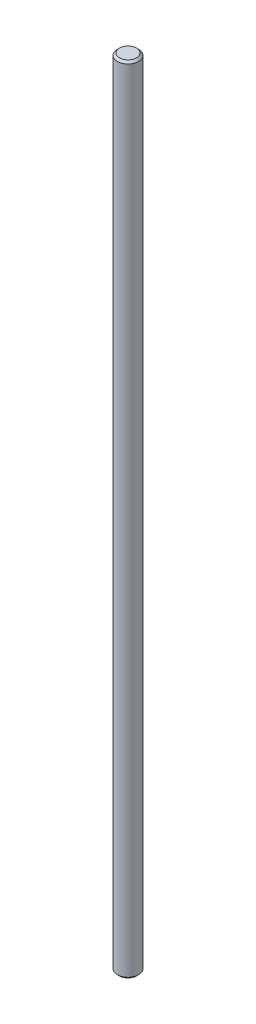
ISO-10303-21;
HEADER;
FILE_DESCRIPTION(('STEP AP214'),'2;1');
FILE_NAME('part.step','',(''),(''),'','','');
FILE_SCHEMA(('AUTOMOTIVE_DESIGN { 1 0 10303 214 1 1 1 1 }'));
ENDSEC;
DATA;
#1=APPLICATION_CONTEXT('core data for automotive mechanical design processes');
#2=APPLICATION_PROTOCOL_DEFINITION('international standard','automotive_design',2000,#1);
#3=PRODUCT_CONTEXT('',#1,'mechanical');
#4=PRODUCT('Part','Part','',(#3));
#5=PRODUCT_RELATED_PRODUCT_CATEGORY('part','',(#4));
#6=PRODUCT_DEFINITION_FORMATION('','',#4);
#7=PRODUCT_DEFINITION_CONTEXT('part definition',#1,'design');
#8=PRODUCT_DEFINITION('design','',#6,#7);
#9=PRODUCT_DEFINITION_SHAPE('','',#8);
#10=(LENGTH_UNIT() NAMED_UNIT(*) SI_UNIT(.MILLI.,.METRE.));
#11=(NAMED_UNIT(*) PLANE_ANGLE_UNIT() SI_UNIT($,.RADIAN.));
#12=(NAMED_UNIT(*) SI_UNIT($,.STERADIAN.) SOLID_ANGLE_UNIT());
#13=UNCERTAINTY_MEASURE_WITH_UNIT(LENGTH_MEASURE(1.E-05),#10,'distance_accuracy_value','');
#14=(GEOMETRIC_REPRESENTATION_CONTEXT(3) GLOBAL_UNCERTAINTY_ASSIGNED_CONTEXT((#13)) GLOBAL_UNIT_ASSIGNED_CONTEXT((#10,
#11,#12)) REPRESENTATION_CONTEXT('',''));
#15=CARTESIAN_POINT('',(0.,0.,0.));
#16=DIRECTION('',(0.,0.,1.));
#17=DIRECTION('',(1.,0.,0.));
#18=AXIS2_PLACEMENT_3D('',#15,#16,#17);
#19=CARTESIAN_POINT('',(0.,150.,0.));
#20=DIRECTION('',(0.,-1.,0.));
#21=DIRECTION('',(0.,0.,-1.));
#22=AXIS2_PLACEMENT_3D('',#19,#20,#21);
#23=CYLINDRICAL_SURFACE('',#22,2.);
#24=CARTESIAN_POINT('',(0.,0.399999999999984,0.));
#25=DIRECTION('',(0.,1.,0.));
#26=DIRECTION('',(0.,0.,1.));
#27=AXIS2_PLACEMENT_3D('',#24,#25,#26);
#28=CIRCLE('',#27,2.);
#29=CARTESIAN_POINT('',(0.,0.399999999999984,2.));
#30=VERTEX_POINT('',#29);
#31=EDGE_CURVE('E40',#30,#30,#28,.T.);
#32=ORIENTED_EDGE('',*,*,#31,.T.);
#33=EDGE_LOOP('',(#32));
#34=FACE_BOUND('',#33,.T.);
#35=CARTESIAN_POINT('',(0.,149.6,0.));
#36=DIRECTION('',(0.,1.,0.));
#37=DIRECTION('',(0.,0.,1.));
#38=AXIS2_PLACEMENT_3D('',#35,#36,#37);
#39=CIRCLE('',#38,2.);
#40=CARTESIAN_POINT('',(0.,149.6,2.));
#41=VERTEX_POINT('',#40);
#42=EDGE_CURVE('E44',#41,#41,#39,.F.);
#43=ORIENTED_EDGE('',*,*,#42,.T.);
#44=EDGE_LOOP('',(#43));
#45=FACE_BOUND('',#44,.T.);
#46=ADVANCED_FACE('F30',(#34,#45),#23,.T.);
#47=CARTESIAN_POINT('',(0.,150.,0.));
#48=DIRECTION('',(0.,1.,0.));
#49=DIRECTION('',(0.,0.,1.));
#50=AXIS2_PLACEMENT_3D('',#47,#48,#49);
#51=PLANE('',#50);
#52=CARTESIAN_POINT('',(0.,150.,0.));
#53=DIRECTION('',(0.,1.,0.));
#54=DIRECTION('',(0.,0.,1.));
#55=AXIS2_PLACEMENT_3D('',#52,#53,#54);
#56=CIRCLE('',#55,1.60000000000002);
#57=CARTESIAN_POINT('',(0.,150.,1.60000000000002));
#58=VERTEX_POINT('',#57);
#59=EDGE_CURVE('E10',#58,#58,#56,.T.);
#60=ORIENTED_EDGE('',*,*,#59,.T.);
#61=EDGE_LOOP('',(#60));
#62=FACE_BOUND('',#61,.T.);
#63=ADVANCED_FACE('F63',(#62),#51,.T.);
#64=CARTESIAN_POINT('',(0.,0.,0.));
#65=DIRECTION('',(0.,1.,0.));
#66=DIRECTION('',(0.,0.,1.));
#67=AXIS2_PLACEMENT_3D('',#64,#65,#66);
#68=PLANE('',#67);
#69=CARTESIAN_POINT('',(0.,0.,0.));
#70=DIRECTION('',(0.,1.,0.));
#71=DIRECTION('',(0.,0.,1.));
#72=AXIS2_PLACEMENT_3D('',#69,#70,#71);
#73=CIRCLE('',#72,1.6);
#74=CARTESIAN_POINT('',(0.,0.,1.6));
#75=VERTEX_POINT('',#74);
#76=EDGE_CURVE('E36',#75,#75,#73,.F.);
#77=ORIENTED_EDGE('',*,*,#76,.T.);
#78=EDGE_LOOP('',(#77));
#79=FACE_BOUND('',#78,.T.);
#80=ADVANCED_FACE('F59',(#79),#68,.F.);
#81=CARTESIAN_POINT('',(0.,0.399999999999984,0.));
#82=DIRECTION('',(0.,1.,0.));
#83=DIRECTION('',(0.,0.,1.));
#84=AXIS2_PLACEMENT_3D('',#81,#82,#83);
#85=CONICAL_SURFACE('',#84,2.,0.785398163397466);
#86=ORIENTED_EDGE('',*,*,#76,.F.);
#87=EDGE_LOOP('',(#86));
#88=FACE_BOUND('',#87,.T.);
#89=ORIENTED_EDGE('',*,*,#31,.F.);
#90=EDGE_LOOP('',(#89));
#91=FACE_BOUND('',#90,.T.);
#92=ADVANCED_FACE('F54',(#88,#91),#85,.T.);
#93=CARTESIAN_POINT('',(0.,150.,0.));
#94=DIRECTION('',(0.,-1.,0.));
#95=DIRECTION('',(0.,0.,-1.));
#96=AXIS2_PLACEMENT_3D('',#93,#94,#95);
#97=CONICAL_SURFACE('',#96,1.60000000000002,0.785398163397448);
#98=ORIENTED_EDGE('',*,*,#42,.F.);
#99=EDGE_LOOP('',(#98));
#100=FACE_BOUND('',#99,.T.);
#101=ORIENTED_EDGE('',*,*,#59,.F.);
#102=EDGE_LOOP('',(#101));
#103=FACE_BOUND('',#102,.T.);
#104=ADVANCED_FACE('F51',(#100,#103),#97,.T.);
#105=CLOSED_SHELL('',(#46,#63,#80,#92,#104));
#106=MANIFOLD_SOLID_BREP('B2',#105);
#107=ADVANCED_BREP_SHAPE_REPRESENTATION('',(#18,#106),#14);
#108=SHAPE_DEFINITION_REPRESENTATION(#9,#107);
ENDSEC;
END-ISO-10303-21;
